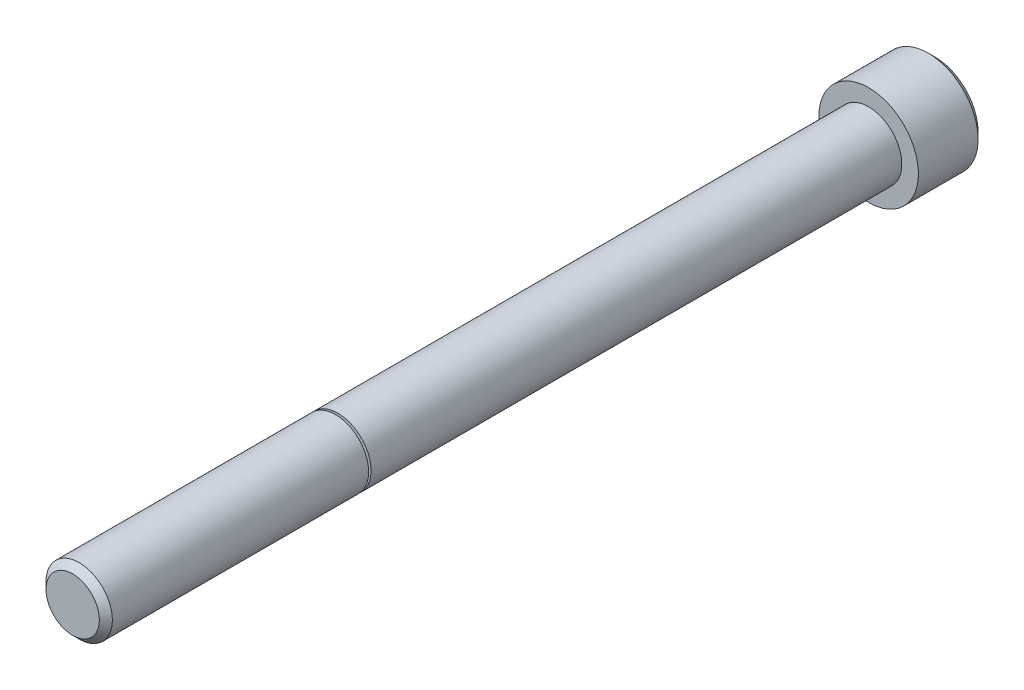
ISO-10303-21;
HEADER;
FILE_DESCRIPTION(('STEP AP214'),'2;1');
FILE_NAME('part.step','',(''),(''),'','','');
FILE_SCHEMA(('AUTOMOTIVE_DESIGN { 1 0 10303 214 1 1 1 1 }'));
ENDSEC;
DATA;
#1=APPLICATION_CONTEXT('core data for automotive mechanical design processes');
#2=APPLICATION_PROTOCOL_DEFINITION('international standard','automotive_design',2000,#1);
#3=PRODUCT_CONTEXT('',#1,'mechanical');
#4=PRODUCT('Part','Part','',(#3));
#5=PRODUCT_RELATED_PRODUCT_CATEGORY('part','',(#4));
#6=PRODUCT_DEFINITION_FORMATION('','',#4);
#7=PRODUCT_DEFINITION_CONTEXT('part definition',#1,'design');
#8=PRODUCT_DEFINITION('design','',#6,#7);
#9=PRODUCT_DEFINITION_SHAPE('','',#8);
#10=(LENGTH_UNIT() NAMED_UNIT(*) SI_UNIT(.MILLI.,.METRE.));
#11=(NAMED_UNIT(*) PLANE_ANGLE_UNIT() SI_UNIT($,.RADIAN.));
#12=(NAMED_UNIT(*) SI_UNIT($,.STERADIAN.) SOLID_ANGLE_UNIT());
#13=UNCERTAINTY_MEASURE_WITH_UNIT(LENGTH_MEASURE(1.E-05),#10,'distance_accuracy_value','');
#14=(GEOMETRIC_REPRESENTATION_CONTEXT(3) GLOBAL_UNCERTAINTY_ASSIGNED_CONTEXT((#13)) GLOBAL_UNIT_ASSIGNED_CONTEXT((#10,
#11,#12)) REPRESENTATION_CONTEXT('',''));
#15=CARTESIAN_POINT('',(0.,0.,0.));
#16=DIRECTION('',(0.,0.,1.));
#17=DIRECTION('',(1.,0.,0.));
#18=AXIS2_PLACEMENT_3D('',#15,#16,#17);
#19=CARTESIAN_POINT('',(0.,3.60822483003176E-13,-6.34999999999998));
#20=DIRECTION('',(0.,0.,1.));
#21=DIRECTION('',(1.,0.,0.));
#22=AXIS2_PLACEMENT_3D('',#19,#20,#21);
#23=PLANE('',#22);
#24=DIRECTION('',(-0.5,-0.866025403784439,0.));
#25=VECTOR('',#24,1.);
#26=CARTESIAN_POINT('',(2.74963065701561,3.60822483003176E-13,-6.34999999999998));
#27=LINE('',#26,#25);
#28=CARTESIAN_POINT('',(2.74963065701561,3.60822483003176E-13,-6.34999999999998));
#29=VERTEX_POINT('',#28);
#30=CARTESIAN_POINT('',(1.37481532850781,-2.38124999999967,-6.35000000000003));
#31=VERTEX_POINT('',#30);
#32=EDGE_CURVE('E145',#29,#31,#27,.T.);
#33=ORIENTED_EDGE('',*,*,#32,.F.);
#34=DIRECTION('',(0.499999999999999,-0.866025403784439,0.));
#35=VECTOR('',#34,1.);
#36=CARTESIAN_POINT('',(1.37481532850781,2.38125000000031,-6.34999999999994));
#37=LINE('',#36,#35);
#38=CARTESIAN_POINT('',(1.37481532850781,2.38125000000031,-6.34999999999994));
#39=VERTEX_POINT('',#38);
#40=EDGE_CURVE('E64',#39,#29,#37,.T.);
#41=ORIENTED_EDGE('',*,*,#40,.F.);
#42=DIRECTION('',(1.,0.,0.));
#43=VECTOR('',#42,1.);
#44=CARTESIAN_POINT('',(-1.37481532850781,2.38125000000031,-6.34999999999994));
#45=LINE('',#44,#43);
#46=CARTESIAN_POINT('',(-1.37481532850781,2.38125000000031,-6.34999999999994));
#47=VERTEX_POINT('',#46);
#48=EDGE_CURVE('E158',#47,#39,#45,.T.);
#49=ORIENTED_EDGE('',*,*,#48,.F.);
#50=DIRECTION('',(0.5,0.866025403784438,0.));
#51=VECTOR('',#50,1.);
#52=CARTESIAN_POINT('',(-2.74963065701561,3.60822483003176E-13,-6.34999999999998));
#53=LINE('',#52,#51);
#54=CARTESIAN_POINT('',(-2.74963065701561,3.60822483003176E-13,-6.34999999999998));
#55=VERTEX_POINT('',#54);
#56=EDGE_CURVE('E155',#55,#47,#53,.T.);
#57=ORIENTED_EDGE('',*,*,#56,.F.);
#58=DIRECTION('',(-0.5,0.866025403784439,0.));
#59=VECTOR('',#58,1.);
#60=CARTESIAN_POINT('',(-1.37481532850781,-2.38124999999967,-6.35000000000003));
#61=LINE('',#60,#59);
#62=CARTESIAN_POINT('',(-1.37481532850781,-2.38124999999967,-6.35000000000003));
#63=VERTEX_POINT('',#62);
#64=EDGE_CURVE('E112',#63,#55,#61,.T.);
#65=ORIENTED_EDGE('',*,*,#64,.F.);
#66=DIRECTION('',(-1.,0.,0.));
#67=VECTOR('',#66,1.);
#68=CARTESIAN_POINT('',(1.37481532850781,-2.38124999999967,-6.35000000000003));
#69=LINE('',#68,#67);
#70=EDGE_CURVE('E149',#31,#63,#69,.T.);
#71=ORIENTED_EDGE('',*,*,#70,.F.);
#72=EDGE_LOOP('',(#33,#41,#49,#57,#65,#71));
#73=FACE_BOUND('',#72,.T.);
#74=CARTESIAN_POINT('',(0.,3.60822483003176E-13,-6.34999999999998));
#75=DIRECTION('',(0.,0.,-1.));
#76=DIRECTION('',(-1.,0.,0.));
#77=AXIS2_PLACEMENT_3D('',#74,#75,#76);
#78=CIRCLE('',#77,4.1275);
#79=CARTESIAN_POINT('',(-4.1275,3.60822483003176E-13,-6.34999999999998));
#80=VERTEX_POINT('',#79);
#81=EDGE_CURVE('E164',#80,#80,#78,.T.);
#82=ORIENTED_EDGE('',*,*,#81,.T.);
#83=EDGE_LOOP('',(#82));
#84=FACE_BOUND('',#83,.T.);
#85=ADVANCED_FACE('F49',(#73,#84),#23,.F.);
#86=CARTESIAN_POINT('',(-2.55270000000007,3.60822483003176E-13,76.2000000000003));
#87=DIRECTION('',(0.,0.,-1.));
#88=DIRECTION('',(-1.,0.,0.));
#89=AXIS2_PLACEMENT_3D('',#86,#87,#88);
#90=PLANE('',#89);
#91=CARTESIAN_POINT('',(0.,3.60822483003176E-13,76.2000000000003));
#92=DIRECTION('',(0.,0.,-1.));
#93=DIRECTION('',(-1.,0.,0.));
#94=AXIS2_PLACEMENT_3D('',#91,#92,#93);
#95=CIRCLE('',#94,2.55270000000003);
#96=CARTESIAN_POINT('',(-2.55270000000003,3.60822483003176E-13,76.2000000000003));
#97=VERTEX_POINT('',#96);
#98=EDGE_CURVE('E11',#97,#97,#95,.T.);
#99=ORIENTED_EDGE('',*,*,#98,.F.);
#100=EDGE_LOOP('',(#99));
#101=FACE_BOUND('',#100,.T.);
#102=ADVANCED_FACE('F214',(#101),#90,.F.);
#103=CARTESIAN_POINT('',(0.,3.60822483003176E-13,76.2000000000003));
#104=DIRECTION('',(0.,0.,-1.));
#105=DIRECTION('',(-1.,0.,0.));
#106=AXIS2_PLACEMENT_3D('',#103,#104,#105);
#107=CONICAL_SURFACE('',#106,2.55270000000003,0.785398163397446);
#108=CARTESIAN_POINT('',(0.,0.,75.5777000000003));
#109=DIRECTION('',(0.,0.,-1.));
#110=DIRECTION('',(-1.,0.,0.));
#111=AXIS2_PLACEMENT_3D('',#108,#109,#110);
#112=CIRCLE('',#111,3.17500000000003);
#113=CARTESIAN_POINT('',(-3.17500000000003,0.,75.5777000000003));
#114=VERTEX_POINT('',#113);
#115=EDGE_CURVE('E57',#114,#114,#112,.T.);
#116=ORIENTED_EDGE('',*,*,#115,.F.);
#117=EDGE_LOOP('',(#116));
#118=FACE_BOUND('',#117,.T.);
#119=ORIENTED_EDGE('',*,*,#98,.T.);
#120=EDGE_LOOP('',(#119));
#121=FACE_BOUND('',#120,.T.);
#122=ADVANCED_FACE('F211',(#118,#121),#107,.T.);
#123=CARTESIAN_POINT('',(0.,-3.88578058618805E-13,-10.5851546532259));
#124=DIRECTION('',(0.,0.,-1.));
#125=DIRECTION('',(-1.,0.,0.));
#126=AXIS2_PLACEMENT_3D('',#123,#124,#125);
#127=CYLINDRICAL_SURFACE('',#126,3.17500000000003);
#128=CARTESIAN_POINT('',(0.,5.41233724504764E-13,51.0364986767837));
#129=DIRECTION('',(0.,0.,-1.));
#130=DIRECTION('',(-1.,0.,0.));
#131=AXIS2_PLACEMENT_3D('',#128,#129,#130);
#132=CIRCLE('',#131,3.17500000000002);
#133=CARTESIAN_POINT('',(-3.17500000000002,5.41233724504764E-13,51.0364986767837));
#134=VERTEX_POINT('',#133);
#135=EDGE_CURVE('E201',#134,#134,#132,.T.);
#136=ORIENTED_EDGE('',*,*,#135,.F.);
#137=EDGE_LOOP('',(#136));
#138=FACE_BOUND('',#137,.T.);
#139=ORIENTED_EDGE('',*,*,#115,.T.);
#140=EDGE_LOOP('',(#139));
#141=FACE_BOUND('',#140,.T.);
#142=ADVANCED_FACE('F209',(#138,#141),#127,.T.);
#143=CARTESIAN_POINT('',(0.,5.41233724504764E-13,51.0364986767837));
#144=DIRECTION('',(0.,0.,1.));
#145=DIRECTION('',(1.,0.,0.));
#146=AXIS2_PLACEMENT_3D('',#143,#144,#145);
#147=CONICAL_SURFACE('',#146,3.17500000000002,1.22173047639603);
#148=CARTESIAN_POINT('',(0.,-4.9960036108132E-13,50.8487938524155));
#149=DIRECTION('',(0.,0.,-1.));
#150=DIRECTION('',(-1.,0.,0.));
#151=AXIS2_PLACEMENT_3D('',#148,#149,#150);
#152=CIRCLE('',#151,2.65928523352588);
#153=CARTESIAN_POINT('',(-2.65928523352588,-4.9960036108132E-13,50.8487938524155));
#154=VERTEX_POINT('',#153);
#155=EDGE_CURVE('E197',#154,#154,#152,.T.);
#156=ORIENTED_EDGE('',*,*,#155,.F.);
#157=EDGE_LOOP('',(#156));
#158=FACE_BOUND('',#157,.T.);
#159=ORIENTED_EDGE('',*,*,#135,.T.);
#160=EDGE_LOOP('',(#159));
#161=FACE_BOUND('',#160,.T.);
#162=ADVANCED_FACE('F227',(#158,#161),#147,.T.);
#163=CARTESIAN_POINT('',(0.,3.60822483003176E-13,50.8299999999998));
#164=DIRECTION('',(0.,0.,-1.));
#165=DIRECTION('',(-1.,0.,0.));
#166=AXIS2_PLACEMENT_3D('',#163,#164,#165);
#167=TOROIDAL_SURFACE('',#166,2.66612563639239,0.0199999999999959);
#168=CARTESIAN_POINT('',(0.,3.60822483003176E-13,50.8099999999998));
#169=DIRECTION('',(0.,0.,-1.));
#170=DIRECTION('',(-1.,0.,0.));
#171=AXIS2_PLACEMENT_3D('',#168,#169,#170);
#172=CIRCLE('',#171,2.66612563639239);
#173=CARTESIAN_POINT('',(-2.66612563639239,3.60822483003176E-13,50.8099999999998));
#174=VERTEX_POINT('',#173);
#175=EDGE_CURVE('E193',#174,#174,#172,.T.);
#176=ORIENTED_EDGE('',*,*,#175,.F.);
#177=EDGE_LOOP('',(#176));
#178=FACE_BOUND('',#177,.T.);
#179=ORIENTED_EDGE('',*,*,#155,.T.);
#180=EDGE_LOOP('',(#179));
#181=FACE_BOUND('',#180,.T.);
#182=ADVANCED_FACE('F231',(#178,#181),#167,.F.);
#183=CARTESIAN_POINT('',(-3.17499999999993,3.60822483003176E-13,50.8099999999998));
#184=DIRECTION('',(0.,0.,-1.));
#185=DIRECTION('',(-1.,0.,0.));
#186=AXIS2_PLACEMENT_3D('',#183,#184,#185);
#187=PLANE('',#186);
#188=CARTESIAN_POINT('',(0.,3.60822483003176E-13,50.8099999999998));
#189=DIRECTION('',(0.,0.,-1.));
#190=DIRECTION('',(-1.,0.,0.));
#191=AXIS2_PLACEMENT_3D('',#188,#189,#190);
#192=CIRCLE('',#191,3.17500000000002);
#193=CARTESIAN_POINT('',(-3.17500000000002,3.60822483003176E-13,50.8099999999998));
#194=VERTEX_POINT('',#193);
#195=EDGE_CURVE('E189',#194,#194,#192,.T.);
#196=ORIENTED_EDGE('',*,*,#195,.F.);
#197=EDGE_LOOP('',(#196));
#198=FACE_BOUND('',#197,.T.);
#199=ORIENTED_EDGE('',*,*,#175,.T.);
#200=EDGE_LOOP('',(#199));
#201=FACE_BOUND('',#200,.T.);
#202=ADVANCED_FACE('F235',(#198,#201),#187,.F.);
#203=CARTESIAN_POINT('',(0.,-3.88578058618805E-13,-10.5851546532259));
#204=DIRECTION('',(0.,0.,-1.));
#205=DIRECTION('',(-1.,0.,0.));
#206=AXIS2_PLACEMENT_3D('',#203,#204,#205);
#207=CYLINDRICAL_SURFACE('',#206,3.17500000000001);
#208=CARTESIAN_POINT('',(0.,0.,0.));
#209=DIRECTION('',(0.,0.,-1.));
#210=DIRECTION('',(-1.,0.,0.));
#211=AXIS2_PLACEMENT_3D('',#208,#209,#210);
#212=CIRCLE('',#211,3.175);
#213=CARTESIAN_POINT('',(-3.175,0.,0.));
#214=VERTEX_POINT('',#213);
#215=EDGE_CURVE('E185',#214,#214,#212,.T.);
#216=ORIENTED_EDGE('',*,*,#215,.F.);
#217=EDGE_LOOP('',(#216));
#218=FACE_BOUND('',#217,.T.);
#219=ORIENTED_EDGE('',*,*,#195,.T.);
#220=EDGE_LOOP('',(#219));
#221=FACE_BOUND('',#220,.T.);
#222=ADVANCED_FACE('F239',(#218,#221),#207,.T.);
#223=CARTESIAN_POINT('',(-4.7625,0.,0.));
#224=DIRECTION('',(0.,0.,-1.));
#225=DIRECTION('',(-1.,0.,0.));
#226=AXIS2_PLACEMENT_3D('',#223,#224,#225);
#227=PLANE('',#226);
#228=CARTESIAN_POINT('',(0.,0.,0.));
#229=DIRECTION('',(0.,0.,-1.));
#230=DIRECTION('',(-1.,0.,0.));
#231=AXIS2_PLACEMENT_3D('',#228,#229,#230);
#232=CIRCLE('',#231,4.7625);
#233=CARTESIAN_POINT('',(-4.7625,0.,0.));
#234=VERTEX_POINT('',#233);
#235=EDGE_CURVE('E181',#234,#234,#232,.T.);
#236=ORIENTED_EDGE('',*,*,#235,.F.);
#237=EDGE_LOOP('',(#236));
#238=FACE_BOUND('',#237,.T.);
#239=ORIENTED_EDGE('',*,*,#215,.T.);
#240=EDGE_LOOP('',(#239));
#241=FACE_BOUND('',#240,.T.);
#242=ADVANCED_FACE('F243',(#238,#241),#227,.F.);
#243=CARTESIAN_POINT('',(0.,-3.88578058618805E-13,-10.5851546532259));
#244=DIRECTION('',(0.,0.,-1.));
#245=DIRECTION('',(-1.,0.,0.));
#246=AXIS2_PLACEMENT_3D('',#243,#244,#245);
#247=CYLINDRICAL_SURFACE('',#246,4.7625);
#248=CARTESIAN_POINT('',(0.,3.60822483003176E-13,-5.71499999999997));
#249=DIRECTION('',(0.,0.,-1.));
#250=DIRECTION('',(-1.,0.,0.));
#251=AXIS2_PLACEMENT_3D('',#248,#249,#250);
#252=CIRCLE('',#251,4.7625);
#253=CARTESIAN_POINT('',(-4.7625,3.60822483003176E-13,-5.71499999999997));
#254=VERTEX_POINT('',#253);
#255=EDGE_CURVE('E177',#254,#254,#252,.T.);
#256=ORIENTED_EDGE('',*,*,#255,.F.);
#257=EDGE_LOOP('',(#256));
#258=FACE_BOUND('',#257,.T.);
#259=ORIENTED_EDGE('',*,*,#235,.T.);
#260=EDGE_LOOP('',(#259));
#261=FACE_BOUND('',#260,.T.);
#262=ADVANCED_FACE('F247',(#258,#261),#247,.T.);
#263=CARTESIAN_POINT('',(0.,3.60822483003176E-13,-5.71499999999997));
#264=DIRECTION('',(0.,0.,1.));
#265=DIRECTION('',(1.,0.,0.));
#266=AXIS2_PLACEMENT_3D('',#263,#264,#265);
#267=CONICAL_SURFACE('',#266,4.7625,0.785398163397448);
#268=ORIENTED_EDGE('',*,*,#81,.F.);
#269=EDGE_LOOP('',(#268));
#270=FACE_BOUND('',#269,.T.);
#271=ORIENTED_EDGE('',*,*,#255,.T.);
#272=EDGE_LOOP('',(#271));
#273=FACE_BOUND('',#272,.T.);
#274=ADVANCED_FACE('F251',(#270,#273),#267,.T.);
#275=CARTESIAN_POINT('',(1.37481532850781,2.38125000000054,-3.17499999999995));
#276=DIRECTION('',(0.866025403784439,0.499999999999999,0.));
#277=DIRECTION('',(-0.5,0.866025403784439,0.));
#278=AXIS2_PLACEMENT_3D('',#275,#276,#277);
#279=PLANE('',#278);
#280=ORIENTED_EDGE('',*,*,#40,.T.);
#281=DIRECTION('',(0.,0.,-1.));
#282=VECTOR('',#281,1.);
#283=CARTESIAN_POINT('',(2.74963065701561,5.41233724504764E-13,-3.17499999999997));
#284=LINE('',#283,#282);
#285=CARTESIAN_POINT('',(2.74963065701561,5.41233724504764E-13,-3.17499999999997));
#286=VERTEX_POINT('',#285);
#287=EDGE_CURVE('E94',#286,#29,#284,.T.);
#288=ORIENTED_EDGE('',*,*,#287,.F.);
#289=DIRECTION('',(0.499999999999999,-0.866025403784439,0.));
#290=VECTOR('',#289,1.);
#291=CARTESIAN_POINT('',(1.37481532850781,2.38125000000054,-3.17499999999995));
#292=LINE('',#291,#290);
#293=CARTESIAN_POINT('',(1.37481532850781,2.38125000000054,-3.17499999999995));
#294=VERTEX_POINT('',#293);
#295=EDGE_CURVE('E161',#294,#286,#292,.T.);
#296=ORIENTED_EDGE('',*,*,#295,.F.);
#297=DIRECTION('',(0.,0.,-1.));
#298=VECTOR('',#297,1.);
#299=CARTESIAN_POINT('',(1.37481532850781,2.38125000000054,-3.17499999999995));
#300=LINE('',#299,#298);
#301=EDGE_CURVE('E72',#294,#39,#300,.T.);
#302=ORIENTED_EDGE('',*,*,#301,.T.);
#303=EDGE_LOOP('',(#280,#288,#296,#302));
#304=FACE_BOUND('',#303,.T.);
#305=ADVANCED_FACE('F255',(#304),#279,.F.);
#306=CARTESIAN_POINT('',(-1.37481532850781,2.38125000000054,-3.17499999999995));
#307=DIRECTION('',(0.,1.,0.));
#308=DIRECTION('',(-1.,0.,0.));
#309=AXIS2_PLACEMENT_3D('',#306,#307,#308);
#310=PLANE('',#309);
#311=ORIENTED_EDGE('',*,*,#48,.T.);
#312=ORIENTED_EDGE('',*,*,#301,.F.);
#313=DIRECTION('',(1.,0.,0.));
#314=VECTOR('',#313,1.);
#315=CARTESIAN_POINT('',(-1.37481532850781,2.38125000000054,-3.17499999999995));
#316=LINE('',#315,#314);
#317=CARTESIAN_POINT('',(-1.37481532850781,2.38125000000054,-3.17499999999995));
#318=VERTEX_POINT('',#317);
#319=EDGE_CURVE('E126',#318,#294,#316,.T.);
#320=ORIENTED_EDGE('',*,*,#319,.F.);
#321=DIRECTION('',(0.,0.,-1.));
#322=VECTOR('',#321,1.);
#323=CARTESIAN_POINT('',(-1.37481532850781,2.38125000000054,-3.17499999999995));
#324=LINE('',#323,#322);
#325=EDGE_CURVE('E117',#318,#47,#324,.T.);
#326=ORIENTED_EDGE('',*,*,#325,.T.);
#327=EDGE_LOOP('',(#311,#312,#320,#326));
#328=FACE_BOUND('',#327,.T.);
#329=ADVANCED_FACE('F259',(#328),#310,.F.);
#330=CARTESIAN_POINT('',(-2.74963065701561,5.41233724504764E-13,-3.17499999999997));
#331=DIRECTION('',(-0.866025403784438,0.5,0.));
#332=DIRECTION('',(-0.5,-0.866025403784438,0.));
#333=AXIS2_PLACEMENT_3D('',#330,#331,#332);
#334=PLANE('',#333);
#335=ORIENTED_EDGE('',*,*,#56,.T.);
#336=ORIENTED_EDGE('',*,*,#325,.F.);
#337=DIRECTION('',(0.5,0.866025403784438,0.));
#338=VECTOR('',#337,1.);
#339=CARTESIAN_POINT('',(-2.74963065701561,5.41233724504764E-13,-3.17499999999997));
#340=LINE('',#339,#338);
#341=CARTESIAN_POINT('',(-2.74963065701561,5.41233724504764E-13,-3.17499999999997));
#342=VERTEX_POINT('',#341);
#343=EDGE_CURVE('E121',#342,#318,#340,.T.);
#344=ORIENTED_EDGE('',*,*,#343,.F.);
#345=DIRECTION('',(0.,0.,-1.));
#346=VECTOR('',#345,1.);
#347=CARTESIAN_POINT('',(-2.74963065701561,5.41233724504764E-13,-3.17499999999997));
#348=LINE('',#347,#346);
#349=EDGE_CURVE('E105',#342,#55,#348,.T.);
#350=ORIENTED_EDGE('',*,*,#349,.T.);
#351=EDGE_LOOP('',(#335,#336,#344,#350));
#352=FACE_BOUND('',#351,.T.);
#353=ADVANCED_FACE('F122',(#352),#334,.F.);
#354=CARTESIAN_POINT('',(-1.37481532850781,-2.38124999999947,-3.175));
#355=DIRECTION('',(-0.866025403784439,-0.5,0.));
#356=DIRECTION('',(0.5,-0.866025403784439,0.));
#357=AXIS2_PLACEMENT_3D('',#354,#355,#356);
#358=PLANE('',#357);
#359=ORIENTED_EDGE('',*,*,#64,.T.);
#360=ORIENTED_EDGE('',*,*,#349,.F.);
#361=DIRECTION('',(-0.5,0.866025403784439,0.));
#362=VECTOR('',#361,1.);
#363=CARTESIAN_POINT('',(-1.37481532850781,-2.38124999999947,-3.175));
#364=LINE('',#363,#362);
#365=CARTESIAN_POINT('',(-1.37481532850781,-2.38124999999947,-3.175));
#366=VERTEX_POINT('',#365);
#367=EDGE_CURVE('E109',#366,#342,#364,.T.);
#368=ORIENTED_EDGE('',*,*,#367,.F.);
#369=DIRECTION('',(0.,0.,-1.));
#370=VECTOR('',#369,1.);
#371=CARTESIAN_POINT('',(-1.37481532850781,-2.38124999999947,-3.175));
#372=LINE('',#371,#370);
#373=EDGE_CURVE('E118',#366,#63,#372,.T.);
#374=ORIENTED_EDGE('',*,*,#373,.T.);
#375=EDGE_LOOP('',(#359,#360,#368,#374));
#376=FACE_BOUND('',#375,.T.);
#377=ADVANCED_FACE('F107',(#376),#358,.F.);
#378=CARTESIAN_POINT('',(1.37481532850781,-2.38124999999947,-3.175));
#379=DIRECTION('',(0.,-1.,0.));
#380=DIRECTION('',(0.,0.,-1.));
#381=AXIS2_PLACEMENT_3D('',#378,#379,#380);
#382=PLANE('',#381);
#383=ORIENTED_EDGE('',*,*,#70,.T.);
#384=ORIENTED_EDGE('',*,*,#373,.F.);
#385=DIRECTION('',(-1.,0.,0.));
#386=VECTOR('',#385,1.);
#387=CARTESIAN_POINT('',(1.37481532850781,-2.38124999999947,-3.175));
#388=LINE('',#387,#386);
#389=CARTESIAN_POINT('',(1.37481532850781,-2.38124999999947,-3.175));
#390=VERTEX_POINT('',#389);
#391=EDGE_CURVE('E132',#390,#366,#388,.T.);
#392=ORIENTED_EDGE('',*,*,#391,.F.);
#393=DIRECTION('',(0.,0.,-1.));
#394=VECTOR('',#393,1.);
#395=CARTESIAN_POINT('',(1.37481532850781,-2.38124999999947,-3.175));
#396=LINE('',#395,#394);
#397=EDGE_CURVE('E169',#390,#31,#396,.T.);
#398=ORIENTED_EDGE('',*,*,#397,.T.);
#399=EDGE_LOOP('',(#383,#384,#392,#398));
#400=FACE_BOUND('',#399,.T.);
#401=ADVANCED_FACE('F263',(#400),#382,.F.);
#402=CARTESIAN_POINT('',(2.74963065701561,5.41233724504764E-13,-3.17499999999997));
#403=DIRECTION('',(0.866025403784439,-0.5,0.));
#404=DIRECTION('',(0.5,0.866025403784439,0.));
#405=AXIS2_PLACEMENT_3D('',#402,#403,#404);
#406=PLANE('',#405);
#407=ORIENTED_EDGE('',*,*,#32,.T.);
#408=ORIENTED_EDGE('',*,*,#397,.F.);
#409=DIRECTION('',(-0.5,-0.866025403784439,0.));
#410=VECTOR('',#409,1.);
#411=CARTESIAN_POINT('',(2.74963065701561,5.41233724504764E-13,-3.17499999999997));
#412=LINE('',#411,#410);
#413=EDGE_CURVE('E137',#286,#390,#412,.T.);
#414=ORIENTED_EDGE('',*,*,#413,.F.);
#415=ORIENTED_EDGE('',*,*,#287,.T.);
#416=EDGE_LOOP('',(#407,#408,#414,#415));
#417=FACE_BOUND('',#416,.T.);
#418=ADVANCED_FACE('F260',(#417),#406,.F.);
#419=CARTESIAN_POINT('',(1.37481532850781,2.38125000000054,-3.17499999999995));
#420=DIRECTION('',(0.,0.,1.));
#421=DIRECTION('',(1.,0.,0.));
#422=AXIS2_PLACEMENT_3D('',#419,#420,#421);
#423=PLANE('',#422);
#424=ORIENTED_EDGE('',*,*,#295,.T.);
#425=ORIENTED_EDGE('',*,*,#413,.T.);
#426=ORIENTED_EDGE('',*,*,#391,.T.);
#427=ORIENTED_EDGE('',*,*,#367,.T.);
#428=ORIENTED_EDGE('',*,*,#343,.T.);
#429=ORIENTED_EDGE('',*,*,#319,.T.);
#430=EDGE_LOOP('',(#424,#425,#426,#427,#428,#429));
#431=FACE_BOUND('',#430,.T.);
#432=ADVANCED_FACE('F129',(#431),#423,.F.);
#433=CLOSED_SHELL('',(#85,#102,#122,#142,#162,#182,#202,#222,#242,#262,#274,#305,#329,#353,#377,
#401,#418,#432));
#434=MANIFOLD_SOLID_BREP('B2',#433);
#435=ADVANCED_BREP_SHAPE_REPRESENTATION('',(#18,#434),#14);
#436=SHAPE_DEFINITION_REPRESENTATION(#9,#435);
ENDSEC;
END-ISO-10303-21;
